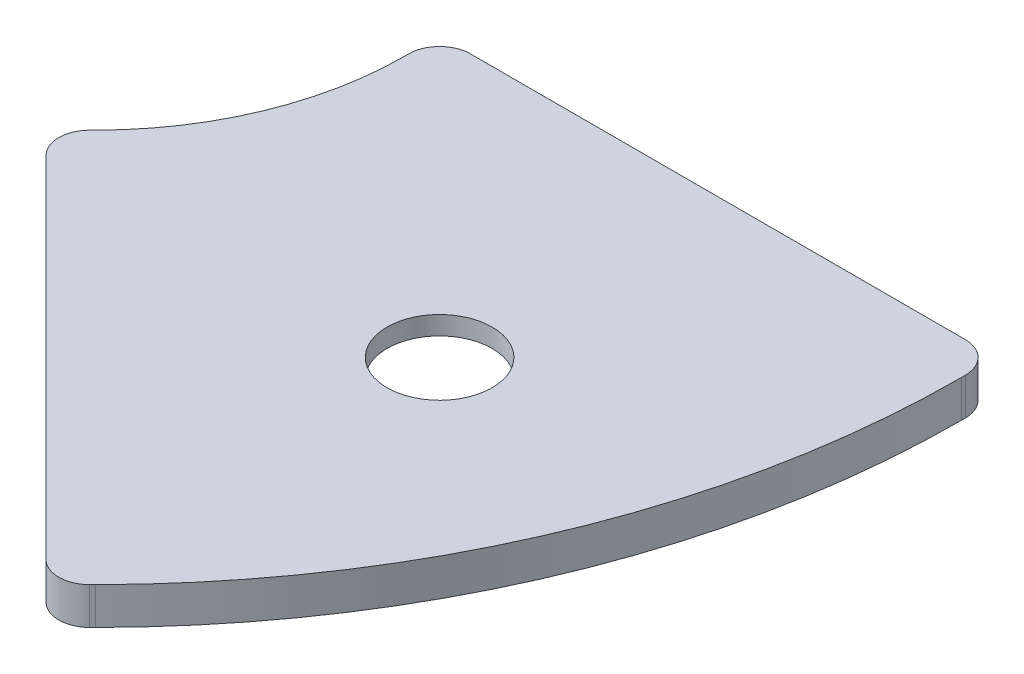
ISO-10303-21;
HEADER;
FILE_DESCRIPTION(('STEP AP214'),'2;1');
FILE_NAME('part.step','',(''),(''),'','','');
FILE_SCHEMA(('AUTOMOTIVE_DESIGN { 1 0 10303 214 1 1 1 1 }'));
ENDSEC;
DATA;
#1=APPLICATION_CONTEXT('core data for automotive mechanical design processes');
#2=APPLICATION_PROTOCOL_DEFINITION('international standard','automotive_design',2000,#1);
#3=PRODUCT_CONTEXT('',#1,'mechanical');
#4=PRODUCT('Part','Part','',(#3));
#5=PRODUCT_RELATED_PRODUCT_CATEGORY('part','',(#4));
#6=PRODUCT_DEFINITION_FORMATION('','',#4);
#7=PRODUCT_DEFINITION_CONTEXT('part definition',#1,'design');
#8=PRODUCT_DEFINITION('design','',#6,#7);
#9=PRODUCT_DEFINITION_SHAPE('','',#8);
#10=(LENGTH_UNIT() NAMED_UNIT(*) SI_UNIT(.MILLI.,.METRE.));
#11=(NAMED_UNIT(*) PLANE_ANGLE_UNIT() SI_UNIT($,.RADIAN.));
#12=(NAMED_UNIT(*) SI_UNIT($,.STERADIAN.) SOLID_ANGLE_UNIT());
#13=UNCERTAINTY_MEASURE_WITH_UNIT(LENGTH_MEASURE(1.E-05),#10,'distance_accuracy_value','');
#14=(GEOMETRIC_REPRESENTATION_CONTEXT(3) GLOBAL_UNCERTAINTY_ASSIGNED_CONTEXT((#13)) GLOBAL_UNIT_ASSIGNED_CONTEXT((#10,
#11,#12)) REPRESENTATION_CONTEXT('',''));
#15=CARTESIAN_POINT('',(0.,0.,0.));
#16=DIRECTION('',(0.,0.,1.));
#17=DIRECTION('',(1.,0.,0.));
#18=AXIS2_PLACEMENT_3D('',#15,#16,#17);
#19=CARTESIAN_POINT('',(22.5,-1.5,22.5));
#20=DIRECTION('',(0.,1.,0.));
#21=DIRECTION('',(1.,0.,0.));
#22=AXIS2_PLACEMENT_3D('',#19,#20,#21);
#23=CYLINDRICAL_SURFACE('',#22,4.25);
#24=CARTESIAN_POINT('',(22.5,0.,22.5));
#25=DIRECTION('',(0.,-1.,0.));
#26=DIRECTION('',(0.,0.,-1.));
#27=AXIS2_PLACEMENT_3D('',#24,#25,#26);
#28=CIRCLE('',#27,4.25);
#29=CARTESIAN_POINT('',(22.5,0.,18.25));
#30=VERTEX_POINT('',#29);
#31=EDGE_CURVE('E194',#30,#30,#28,.T.);
#32=ORIENTED_EDGE('',*,*,#31,.F.);
#33=EDGE_LOOP('',(#32));
#34=FACE_BOUND('',#33,.T.);
#35=CARTESIAN_POINT('',(22.5,-1.5,22.5));
#36=DIRECTION('',(0.,-1.,0.));
#37=DIRECTION('',(0.,0.,-1.));
#38=AXIS2_PLACEMENT_3D('',#35,#36,#37);
#39=CIRCLE('',#38,4.25);
#40=CARTESIAN_POINT('',(22.5,-1.5,18.25));
#41=VERTEX_POINT('',#40);
#42=EDGE_CURVE('E9',#41,#41,#39,.T.);
#43=ORIENTED_EDGE('',*,*,#42,.T.);
#44=EDGE_LOOP('',(#43));
#45=FACE_BOUND('',#44,.T.);
#46=ADVANCED_FACE('F15',(#34,#45),#23,.F.);
#47=CARTESIAN_POINT('',(22.5,-2.3,22.5));
#48=DIRECTION('',(0.,1.,0.));
#49=DIRECTION('',(1.,0.,0.));
#50=AXIS2_PLACEMENT_3D('',#47,#48,#49);
#51=CYLINDRICAL_SURFACE('',#50,6.5);
#52=CARTESIAN_POINT('',(22.5,-1.5,22.5));
#53=DIRECTION('',(0.,1.,0.));
#54=DIRECTION('',(1.,0.,0.));
#55=AXIS2_PLACEMENT_3D('',#52,#53,#54);
#56=CIRCLE('',#55,6.5);
#57=CARTESIAN_POINT('',(29.,-1.5,22.5));
#58=VERTEX_POINT('',#57);
#59=EDGE_CURVE('E25',#58,#58,#56,.T.);
#60=ORIENTED_EDGE('',*,*,#59,.T.);
#61=EDGE_LOOP('',(#60));
#62=FACE_BOUND('',#61,.T.);
#63=CARTESIAN_POINT('',(22.5,-3.,22.5));
#64=DIRECTION('',(0.,1.,0.));
#65=DIRECTION('',(1.,0.,0.));
#66=AXIS2_PLACEMENT_3D('',#63,#64,#65);
#67=CIRCLE('',#66,6.5);
#68=CARTESIAN_POINT('',(29.,-3.,22.5));
#69=VERTEX_POINT('',#68);
#70=EDGE_CURVE('E204',#69,#69,#67,.T.);
#71=ORIENTED_EDGE('',*,*,#70,.F.);
#72=EDGE_LOOP('',(#71));
#73=FACE_BOUND('',#72,.T.);
#74=ADVANCED_FACE('F214',(#62,#73),#51,.F.);
#75=CARTESIAN_POINT('',(22.5,-1.5,22.5));
#76=DIRECTION('',(0.,1.,0.));
#77=DIRECTION('',(0.,0.,1.));
#78=AXIS2_PLACEMENT_3D('',#75,#76,#77);
#79=PLANE('',#78);
#80=ORIENTED_EDGE('',*,*,#59,.F.);
#81=EDGE_LOOP('',(#80));
#82=FACE_BOUND('',#81,.T.);
#83=ORIENTED_EDGE('',*,*,#42,.F.);
#84=EDGE_LOOP('',(#83));
#85=FACE_BOUND('',#84,.T.);
#86=ADVANCED_FACE('F218',(#82,#85),#79,.F.);
#87=CARTESIAN_POINT('',(0.,0.,2.5));
#88=DIRECTION('',(-1.,0.,0.));
#89=DIRECTION('',(0.,0.,1.));
#90=AXIS2_PLACEMENT_3D('',#87,#88,#89);
#91=PLANE('',#90);
#92=DIRECTION('',(0.,0.,1.));
#93=VECTOR('',#92,1.);
#94=CARTESIAN_POINT('',(0.,-3.,2.5));
#95=LINE('',#94,#93);
#96=CARTESIAN_POINT('',(0.,-3.,2.5));
#97=VERTEX_POINT('',#96);
#98=CARTESIAN_POINT('',(0.,-3.,2.82485579));
#99=VERTEX_POINT('',#98);
#100=EDGE_CURVE('E201',#97,#99,#95,.T.);
#101=ORIENTED_EDGE('',*,*,#100,.T.);
#102=DIRECTION('',(0.,-1.,0.));
#103=VECTOR('',#102,1.);
#104=CARTESIAN_POINT('',(0.,0.,2.82485579));
#105=LINE('',#104,#103);
#106=CARTESIAN_POINT('',(0.,0.,2.82485579));
#107=VERTEX_POINT('',#106);
#108=EDGE_CURVE('E34',#107,#99,#105,.T.);
#109=ORIENTED_EDGE('',*,*,#108,.F.);
#110=DIRECTION('',(0.,0.,-1.));
#111=VECTOR('',#110,1.);
#112=CARTESIAN_POINT('',(0.,0.,2.82485579));
#113=LINE('',#112,#111);
#114=CARTESIAN_POINT('',(0.,0.,2.5));
#115=VERTEX_POINT('',#114);
#116=EDGE_CURVE('E199',#107,#115,#113,.T.);
#117=ORIENTED_EDGE('',*,*,#116,.T.);
#118=DIRECTION('',(0.,-1.,0.));
#119=VECTOR('',#118,1.);
#120=CARTESIAN_POINT('',(0.,0.,2.5));
#121=LINE('',#120,#119);
#122=EDGE_CURVE('E126',#115,#97,#121,.T.);
#123=ORIENTED_EDGE('',*,*,#122,.T.);
#124=EDGE_LOOP('',(#101,#109,#117,#123));
#125=FACE_BOUND('',#124,.T.);
#126=ADVANCED_FACE('F220',(#125),#91,.T.);
#127=CARTESIAN_POINT('',(-25.0000000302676,0.,2.82485577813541));
#128=DIRECTION('',(0.,1.,0.));
#129=DIRECTION('',(1.,0.,0.));
#130=AXIS2_PLACEMENT_3D('',#127,#128,#129);
#131=CYLINDRICAL_SURFACE('',#130,25.0000000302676);
#132=CARTESIAN_POINT('',(-25.0000000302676,-3.,2.82485577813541));
#133=DIRECTION('',(0.,-1.,0.));
#134=DIRECTION('',(0.,0.,-1.));
#135=AXIS2_PLACEMENT_3D('',#132,#133,#134);
#136=CIRCLE('',#135,25.0000000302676);
#137=CARTESIAN_POINT('',(-7.32233047,-3.,20.50252532));
#138=VERTEX_POINT('',#137);
#139=EDGE_CURVE('E196',#99,#138,#136,.T.);
#140=ORIENTED_EDGE('',*,*,#139,.T.);
#141=DIRECTION('',(0.,-1.,0.));
#142=VECTOR('',#141,1.);
#143=CARTESIAN_POINT('',(-7.32233047,0.,20.50252532));
#144=LINE('',#143,#142);
#145=CARTESIAN_POINT('',(-7.32233047,0.,20.50252532));
#146=VERTEX_POINT('',#145);
#147=EDGE_CURVE('E185',#146,#138,#144,.T.);
#148=ORIENTED_EDGE('',*,*,#147,.F.);
#149=CARTESIAN_POINT('',(-25.0000000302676,0.,2.82485577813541));
#150=DIRECTION('',(0.,-1.,0.));
#151=DIRECTION('',(0.,0.,-1.));
#152=AXIS2_PLACEMENT_3D('',#149,#150,#151);
#153=CIRCLE('',#152,25.0000000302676);
#154=EDGE_CURVE('E112',#107,#146,#153,.T.);
#155=ORIENTED_EDGE('',*,*,#154,.F.);
#156=ORIENTED_EDGE('',*,*,#108,.T.);
#157=EDGE_LOOP('',(#140,#148,#155,#156));
#158=FACE_BOUND('',#157,.T.);
#159=ADVANCED_FACE('F228',(#158),#131,.F.);
#160=CARTESIAN_POINT('',(-7.32233047,0.,20.50252532));
#161=DIRECTION('',(-0.707106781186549,0.,-0.707106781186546));
#162=DIRECTION('',(-0.707106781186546,0.,0.707106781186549));
#163=AXIS2_PLACEMENT_3D('',#160,#161,#162);
#164=PLANE('',#163);
#165=DIRECTION('',(-0.707106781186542,0.,0.707106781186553));
#166=VECTOR('',#165,1.);
#167=CARTESIAN_POINT('',(-7.32233047,-3.,20.50252532));
#168=LINE('',#167,#166);
#169=CARTESIAN_POINT('',(-7.5520382,-3.,20.73223305));
#170=VERTEX_POINT('',#169);
#171=EDGE_CURVE('E189',#138,#170,#168,.T.);
#172=ORIENTED_EDGE('',*,*,#171,.T.);
#173=DIRECTION('',(0.,-1.,0.));
#174=VECTOR('',#173,1.);
#175=CARTESIAN_POINT('',(-7.5520382,0.,20.73223305));
#176=LINE('',#175,#174);
#177=CARTESIAN_POINT('',(-7.5520382,0.,20.73223305));
#178=VERTEX_POINT('',#177);
#179=EDGE_CURVE('E177',#178,#170,#176,.T.);
#180=ORIENTED_EDGE('',*,*,#179,.F.);
#181=DIRECTION('',(0.707106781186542,0.,-0.707106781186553));
#182=VECTOR('',#181,1.);
#183=CARTESIAN_POINT('',(-7.5520382,0.,20.73223305));
#184=LINE('',#183,#182);
#185=EDGE_CURVE('E186',#178,#146,#184,.T.);
#186=ORIENTED_EDGE('',*,*,#185,.T.);
#187=ORIENTED_EDGE('',*,*,#147,.T.);
#188=EDGE_LOOP('',(#172,#180,#186,#187));
#189=FACE_BOUND('',#188,.T.);
#190=ADVANCED_FACE('F235',(#189),#164,.T.);
#191=CARTESIAN_POINT('',(-5.78427125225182,0.,22.500000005));
#192=DIRECTION('',(0.,1.,0.));
#193=DIRECTION('',(1.,0.,0.));
#194=AXIS2_PLACEMENT_3D('',#191,#192,#193);
#195=CYLINDRICAL_SURFACE('',#194,2.49999999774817);
#196=CARTESIAN_POINT('',(-5.78427125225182,-3.,22.500000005));
#197=DIRECTION('',(0.,1.,0.));
#198=DIRECTION('',(1.,0.,0.));
#199=AXIS2_PLACEMENT_3D('',#196,#197,#198);
#200=CIRCLE('',#199,2.49999999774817);
#201=CARTESIAN_POINT('',(-7.5520382,-3.,24.26776696));
#202=VERTEX_POINT('',#201);
#203=EDGE_CURVE('E181',#170,#202,#200,.T.);
#204=ORIENTED_EDGE('',*,*,#203,.T.);
#205=DIRECTION('',(0.,-1.,0.));
#206=VECTOR('',#205,1.);
#207=CARTESIAN_POINT('',(-7.5520382,0.,24.26776696));
#208=LINE('',#207,#206);
#209=CARTESIAN_POINT('',(-7.5520382,0.,24.26776696));
#210=VERTEX_POINT('',#209);
#211=EDGE_CURVE('E169',#210,#202,#208,.T.);
#212=ORIENTED_EDGE('',*,*,#211,.F.);
#213=CARTESIAN_POINT('',(-5.78427125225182,0.,22.500000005));
#214=DIRECTION('',(0.,-1.,0.));
#215=DIRECTION('',(0.,0.,-1.));
#216=AXIS2_PLACEMENT_3D('',#213,#214,#215);
#217=CIRCLE('',#216,2.49999999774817);
#218=EDGE_CURVE('E178',#210,#178,#217,.T.);
#219=ORIENTED_EDGE('',*,*,#218,.T.);
#220=ORIENTED_EDGE('',*,*,#179,.T.);
#221=EDGE_LOOP('',(#204,#212,#219,#220));
#222=FACE_BOUND('',#221,.T.);
#223=ADVANCED_FACE('F238',(#222),#195,.T.);
#224=CARTESIAN_POINT('',(-7.5520382,0.,24.26776696));
#225=DIRECTION('',(-0.707106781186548,0.,0.707106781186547));
#226=DIRECTION('',(0.707106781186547,0.,0.707106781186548));
#227=AXIS2_PLACEMENT_3D('',#224,#225,#226);
#228=PLANE('',#227);
#229=DIRECTION('',(0.707106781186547,0.,0.707106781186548));
#230=VECTOR('',#229,1.);
#231=CARTESIAN_POINT('',(-7.5520382,-3.,24.26776696));
#232=LINE('',#231,#230);
#233=CARTESIAN_POINT('',(20.73223305,-3.,52.55203821));
#234=VERTEX_POINT('',#233);
#235=EDGE_CURVE('E173',#202,#234,#232,.T.);
#236=ORIENTED_EDGE('',*,*,#235,.T.);
#237=DIRECTION('',(0.,-1.,0.));
#238=VECTOR('',#237,1.);
#239=CARTESIAN_POINT('',(20.73223305,0.,52.55203821));
#240=LINE('',#239,#238);
#241=CARTESIAN_POINT('',(20.73223305,0.,52.55203821));
#242=VERTEX_POINT('',#241);
#243=EDGE_CURVE('E161',#242,#234,#240,.T.);
#244=ORIENTED_EDGE('',*,*,#243,.F.);
#245=DIRECTION('',(-0.707106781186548,0.,-0.707106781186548));
#246=VECTOR('',#245,1.);
#247=CARTESIAN_POINT('',(20.73223305,0.,52.55203821));
#248=LINE('',#247,#246);
#249=EDGE_CURVE('E170',#242,#210,#248,.T.);
#250=ORIENTED_EDGE('',*,*,#249,.T.);
#251=ORIENTED_EDGE('',*,*,#211,.T.);
#252=EDGE_LOOP('',(#236,#244,#250,#251));
#253=FACE_BOUND('',#252,.T.);
#254=ADVANCED_FACE('F240',(#253),#228,.T.);
#255=CARTESIAN_POINT('',(22.500000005,0.,50.7842712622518));
#256=DIRECTION('',(0.,1.,0.));
#257=DIRECTION('',(1.,0.,0.));
#258=AXIS2_PLACEMENT_3D('',#255,#256,#257);
#259=CYLINDRICAL_SURFACE('',#258,2.49999999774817);
#260=CARTESIAN_POINT('',(22.500000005,-3.,50.7842712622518));
#261=DIRECTION('',(0.,1.,0.));
#262=DIRECTION('',(1.,0.,0.));
#263=AXIS2_PLACEMENT_3D('',#260,#261,#262);
#264=CIRCLE('',#263,2.49999999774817);
#265=CARTESIAN_POINT('',(24.26776696,-3.,52.55203821));
#266=VERTEX_POINT('',#265);
#267=EDGE_CURVE('E165',#234,#266,#264,.T.);
#268=ORIENTED_EDGE('',*,*,#267,.T.);
#269=DIRECTION('',(0.,-1.,0.));
#270=VECTOR('',#269,1.);
#271=CARTESIAN_POINT('',(24.26776696,0.,52.55203821));
#272=LINE('',#271,#270);
#273=CARTESIAN_POINT('',(24.26776696,0.,52.55203821));
#274=VERTEX_POINT('',#273);
#275=EDGE_CURVE('E153',#274,#266,#272,.T.);
#276=ORIENTED_EDGE('',*,*,#275,.F.);
#277=CARTESIAN_POINT('',(22.500000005,0.,50.7842712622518));
#278=DIRECTION('',(0.,-1.,0.));
#279=DIRECTION('',(0.,0.,-1.));
#280=AXIS2_PLACEMENT_3D('',#277,#278,#279);
#281=CIRCLE('',#280,2.49999999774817);
#282=EDGE_CURVE('E162',#274,#242,#281,.T.);
#283=ORIENTED_EDGE('',*,*,#282,.T.);
#284=ORIENTED_EDGE('',*,*,#243,.T.);
#285=EDGE_LOOP('',(#268,#276,#283,#284));
#286=FACE_BOUND('',#285,.T.);
#287=ADVANCED_FACE('F243',(#286),#259,.T.);
#288=CARTESIAN_POINT('',(24.26776696,0.,52.55203821));
#289=DIRECTION('',(0.707106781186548,0.,0.707106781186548));
#290=DIRECTION('',(0.707106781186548,0.,-0.707106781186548));
#291=AXIS2_PLACEMENT_3D('',#288,#289,#290);
#292=PLANE('',#291);
#293=DIRECTION('',(0.707106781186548,0.,-0.707106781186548));
#294=VECTOR('',#293,1.);
#295=CARTESIAN_POINT('',(24.26776696,-3.,52.55203821));
#296=LINE('',#295,#294);
#297=CARTESIAN_POINT('',(24.49747469,-3.,52.32233048));
#298=VERTEX_POINT('',#297);
#299=EDGE_CURVE('E157',#266,#298,#296,.T.);
#300=ORIENTED_EDGE('',*,*,#299,.T.);
#301=DIRECTION('',(0.,-1.,0.));
#302=VECTOR('',#301,1.);
#303=CARTESIAN_POINT('',(24.49747469,0.,52.32233048));
#304=LINE('',#303,#302);
#305=CARTESIAN_POINT('',(24.49747469,0.,52.32233048));
#306=VERTEX_POINT('',#305);
#307=EDGE_CURVE('E145',#306,#298,#304,.T.);
#308=ORIENTED_EDGE('',*,*,#307,.F.);
#309=DIRECTION('',(-0.707106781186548,0.,0.707106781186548));
#310=VECTOR('',#309,1.);
#311=CARTESIAN_POINT('',(24.49747469,0.,52.32233048));
#312=LINE('',#311,#310);
#313=EDGE_CURVE('E154',#306,#274,#312,.T.);
#314=ORIENTED_EDGE('',*,*,#313,.T.);
#315=ORIENTED_EDGE('',*,*,#275,.T.);
#316=EDGE_LOOP('',(#300,#308,#314,#315));
#317=FACE_BOUND('',#316,.T.);
#318=ADVANCED_FACE('F245',(#317),#292,.T.);
#319=CARTESIAN_POINT('',(-25.0000000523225,0.,2.8248557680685));
#320=DIRECTION('',(0.,1.,0.));
#321=DIRECTION('',(1.,0.,0.));
#322=AXIS2_PLACEMENT_3D('',#319,#320,#321);
#323=CYLINDRICAL_SURFACE('',#322,70.0000000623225);
#324=CARTESIAN_POINT('',(-25.0000000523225,-3.,2.8248557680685));
#325=DIRECTION('',(0.,1.,0.));
#326=DIRECTION('',(1.,0.,0.));
#327=AXIS2_PLACEMENT_3D('',#324,#325,#326);
#328=CIRCLE('',#327,70.0000000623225);
#329=CARTESIAN_POINT('',(45.00000001,-3.,2.8248558));
#330=VERTEX_POINT('',#329);
#331=EDGE_CURVE('E149',#298,#330,#328,.T.);
#332=ORIENTED_EDGE('',*,*,#331,.T.);
#333=DIRECTION('',(0.,-1.,0.));
#334=VECTOR('',#333,1.);
#335=CARTESIAN_POINT('',(45.00000001,0.,2.8248558));
#336=LINE('',#335,#334);
#337=CARTESIAN_POINT('',(45.00000001,0.,2.8248558));
#338=VERTEX_POINT('',#337);
#339=EDGE_CURVE('E137',#338,#330,#336,.T.);
#340=ORIENTED_EDGE('',*,*,#339,.F.);
#341=CARTESIAN_POINT('',(-25.0000000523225,0.,2.8248557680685));
#342=DIRECTION('',(0.,-1.,0.));
#343=DIRECTION('',(0.,0.,-1.));
#344=AXIS2_PLACEMENT_3D('',#341,#342,#343);
#345=CIRCLE('',#344,70.0000000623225);
#346=EDGE_CURVE('E146',#338,#306,#345,.T.);
#347=ORIENTED_EDGE('',*,*,#346,.T.);
#348=ORIENTED_EDGE('',*,*,#307,.T.);
#349=EDGE_LOOP('',(#332,#340,#347,#348));
#350=FACE_BOUND('',#349,.T.);
#351=ADVANCED_FACE('F248',(#350),#323,.T.);
#352=CARTESIAN_POINT('',(45.00000001,0.,2.8248558));
#353=DIRECTION('',(1.,0.,0.));
#354=DIRECTION('',(0.,0.,-1.));
#355=AXIS2_PLACEMENT_3D('',#352,#353,#354);
#356=PLANE('',#355);
#357=DIRECTION('',(0.,0.,-1.));
#358=VECTOR('',#357,1.);
#359=CARTESIAN_POINT('',(45.00000001,-3.,2.8248558));
#360=LINE('',#359,#358);
#361=CARTESIAN_POINT('',(45.00000001,-3.,2.50000001));
#362=VERTEX_POINT('',#361);
#363=EDGE_CURVE('E141',#330,#362,#360,.T.);
#364=ORIENTED_EDGE('',*,*,#363,.T.);
#365=DIRECTION('',(0.,-1.,0.));
#366=VECTOR('',#365,1.);
#367=CARTESIAN_POINT('',(45.00000001,0.,2.50000001));
#368=LINE('',#367,#366);
#369=CARTESIAN_POINT('',(45.00000001,0.,2.50000001));
#370=VERTEX_POINT('',#369);
#371=EDGE_CURVE('E132',#370,#362,#368,.T.);
#372=ORIENTED_EDGE('',*,*,#371,.F.);
#373=DIRECTION('',(0.,0.,1.));
#374=VECTOR('',#373,1.);
#375=CARTESIAN_POINT('',(45.00000001,0.,2.50000001));
#376=LINE('',#375,#374);
#377=EDGE_CURVE('E138',#370,#338,#376,.T.);
#378=ORIENTED_EDGE('',*,*,#377,.T.);
#379=ORIENTED_EDGE('',*,*,#339,.T.);
#380=EDGE_LOOP('',(#364,#372,#378,#379));
#381=FACE_BOUND('',#380,.T.);
#382=ADVANCED_FACE('F250',(#381),#356,.T.);
#383=CARTESIAN_POINT('',(42.4999999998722,0.,2.50000002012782));
#384=DIRECTION('',(0.,1.,0.));
#385=DIRECTION('',(1.,0.,0.));
#386=AXIS2_PLACEMENT_3D('',#383,#384,#385);
#387=CYLINDRICAL_SURFACE('',#386,2.50000001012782);
#388=CARTESIAN_POINT('',(42.4999999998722,-3.,2.50000002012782));
#389=DIRECTION('',(0.,1.,0.));
#390=DIRECTION('',(1.,0.,0.));
#391=AXIS2_PLACEMENT_3D('',#388,#389,#390);
#392=CIRCLE('',#391,2.50000001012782);
#393=CARTESIAN_POINT('',(42.50000001,-3.,1.00000017E-08));
#394=VERTEX_POINT('',#393);
#395=EDGE_CURVE('E133',#362,#394,#392,.T.);
#396=ORIENTED_EDGE('',*,*,#395,.T.);
#397=DIRECTION('',(0.,-1.,0.));
#398=VECTOR('',#397,1.);
#399=CARTESIAN_POINT('',(42.50000001,0.,1.00000017E-08));
#400=LINE('',#399,#398);
#401=CARTESIAN_POINT('',(42.50000001,0.,1.00000017E-08));
#402=VERTEX_POINT('',#401);
#403=EDGE_CURVE('E123',#402,#394,#400,.T.);
#404=ORIENTED_EDGE('',*,*,#403,.F.);
#405=CARTESIAN_POINT('',(42.4999999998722,0.,2.50000002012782));
#406=DIRECTION('',(0.,-1.,0.));
#407=DIRECTION('',(0.,0.,-1.));
#408=AXIS2_PLACEMENT_3D('',#405,#406,#407);
#409=CIRCLE('',#408,2.50000001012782);
#410=EDGE_CURVE('E122',#402,#370,#409,.T.);
#411=ORIENTED_EDGE('',*,*,#410,.T.);
#412=ORIENTED_EDGE('',*,*,#371,.T.);
#413=EDGE_LOOP('',(#396,#404,#411,#412));
#414=FACE_BOUND('',#413,.T.);
#415=ADVANCED_FACE('F253',(#414),#387,.T.);
#416=CARTESIAN_POINT('',(42.50000001,0.,1.00000017E-08));
#417=DIRECTION('',(0.,0.,-1.));
#418=DIRECTION('',(-1.,0.,0.));
#419=AXIS2_PLACEMENT_3D('',#416,#417,#418);
#420=PLANE('',#419);
#421=DIRECTION('',(-1.,0.,0.));
#422=VECTOR('',#421,1.);
#423=CARTESIAN_POINT('',(42.50000001,-3.,1.00000017E-08));
#424=LINE('',#423,#422);
#425=CARTESIAN_POINT('',(2.5,-3.,4.81481564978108E-09));
#426=VERTEX_POINT('',#425);
#427=EDGE_CURVE('E110',#394,#426,#424,.T.);
#428=ORIENTED_EDGE('',*,*,#427,.T.);
#429=DIRECTION('',(0.,-1.,0.));
#430=VECTOR('',#429,1.);
#431=CARTESIAN_POINT('',(2.5,0.,0.));
#432=LINE('',#431,#430);
#433=CARTESIAN_POINT('',(2.5,0.,4.81481564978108E-09));
#434=VERTEX_POINT('',#433);
#435=EDGE_CURVE('E102',#434,#426,#432,.T.);
#436=ORIENTED_EDGE('',*,*,#435,.F.);
#437=DIRECTION('',(1.,0.,0.));
#438=VECTOR('',#437,1.);
#439=CARTESIAN_POINT('',(2.5,0.,1.00000017E-08));
#440=LINE('',#439,#438);
#441=EDGE_CURVE('E108',#434,#402,#440,.T.);
#442=ORIENTED_EDGE('',*,*,#441,.T.);
#443=ORIENTED_EDGE('',*,*,#403,.T.);
#444=EDGE_LOOP('',(#428,#436,#442,#443));
#445=FACE_BOUND('',#444,.T.);
#446=ADVANCED_FACE('F107',(#445),#420,.T.);
#447=CARTESIAN_POINT('',(2.50000001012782,0.,2.50000001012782));
#448=DIRECTION('',(0.,1.,0.));
#449=DIRECTION('',(1.,0.,0.));
#450=AXIS2_PLACEMENT_3D('',#447,#448,#449);
#451=CYLINDRICAL_SURFACE('',#450,2.50000001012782);
#452=CARTESIAN_POINT('',(2.50000001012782,-3.,2.50000001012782));
#453=DIRECTION('',(0.,1.,0.));
#454=DIRECTION('',(1.,0.,0.));
#455=AXIS2_PLACEMENT_3D('',#452,#453,#454);
#456=CIRCLE('',#455,2.50000001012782);
#457=EDGE_CURVE('E128',#426,#97,#456,.T.);
#458=ORIENTED_EDGE('',*,*,#457,.T.);
#459=ORIENTED_EDGE('',*,*,#122,.F.);
#460=CARTESIAN_POINT('',(2.50000001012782,0.,2.50000001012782));
#461=DIRECTION('',(0.,-1.,0.));
#462=DIRECTION('',(0.,0.,-1.));
#463=AXIS2_PLACEMENT_3D('',#460,#461,#462);
#464=CIRCLE('',#463,2.50000001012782);
#465=EDGE_CURVE('E19',#115,#434,#464,.T.);
#466=ORIENTED_EDGE('',*,*,#465,.T.);
#467=ORIENTED_EDGE('',*,*,#435,.T.);
#468=EDGE_LOOP('',(#458,#459,#466,#467));
#469=FACE_BOUND('',#468,.T.);
#470=ADVANCED_FACE('F17',(#469),#451,.T.);
#471=CARTESIAN_POINT('',(20.0361348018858,0.,21.4794336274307));
#472=DIRECTION('',(0.,-1.,0.));
#473=DIRECTION('',(0.,0.,-1.));
#474=AXIS2_PLACEMENT_3D('',#471,#472,#473);
#475=PLANE('',#474);
#476=ORIENTED_EDGE('',*,*,#465,.F.);
#477=ORIENTED_EDGE('',*,*,#116,.F.);
#478=ORIENTED_EDGE('',*,*,#154,.T.);
#479=ORIENTED_EDGE('',*,*,#185,.F.);
#480=ORIENTED_EDGE('',*,*,#218,.F.);
#481=ORIENTED_EDGE('',*,*,#249,.F.);
#482=ORIENTED_EDGE('',*,*,#282,.F.);
#483=ORIENTED_EDGE('',*,*,#313,.F.);
#484=ORIENTED_EDGE('',*,*,#346,.F.);
#485=ORIENTED_EDGE('',*,*,#377,.F.);
#486=ORIENTED_EDGE('',*,*,#410,.F.);
#487=ORIENTED_EDGE('',*,*,#441,.F.);
#488=EDGE_LOOP('',(#476,#477,#478,#479,#480,#481,#482,#483,#484,#485,#486,#487));
#489=FACE_BOUND('',#488,.T.);
#490=ORIENTED_EDGE('',*,*,#31,.T.);
#491=EDGE_LOOP('',(#490));
#492=FACE_BOUND('',#491,.T.);
#493=ADVANCED_FACE('F117',(#489,#492),#475,.F.);
#494=CARTESIAN_POINT('',(20.0361348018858,-3.,21.4794336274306));
#495=DIRECTION('',(0.,-1.,0.));
#496=DIRECTION('',(0.,0.,-1.));
#497=AXIS2_PLACEMENT_3D('',#494,#495,#496);
#498=PLANE('',#497);
#499=ORIENTED_EDGE('',*,*,#100,.F.);
#500=ORIENTED_EDGE('',*,*,#457,.F.);
#501=ORIENTED_EDGE('',*,*,#427,.F.);
#502=ORIENTED_EDGE('',*,*,#395,.F.);
#503=ORIENTED_EDGE('',*,*,#363,.F.);
#504=ORIENTED_EDGE('',*,*,#331,.F.);
#505=ORIENTED_EDGE('',*,*,#299,.F.);
#506=ORIENTED_EDGE('',*,*,#267,.F.);
#507=ORIENTED_EDGE('',*,*,#235,.F.);
#508=ORIENTED_EDGE('',*,*,#203,.F.);
#509=ORIENTED_EDGE('',*,*,#171,.F.);
#510=ORIENTED_EDGE('',*,*,#139,.F.);
#511=EDGE_LOOP('',(#499,#500,#501,#502,#503,#504,#505,#506,#507,#508,#509,#510));
#512=FACE_BOUND('',#511,.T.);
#513=ORIENTED_EDGE('',*,*,#70,.T.);
#514=EDGE_LOOP('',(#513));
#515=FACE_BOUND('',#514,.T.);
#516=ADVANCED_FACE('F259',(#512,#515),#498,.T.);
#517=CLOSED_SHELL('',(#46,#74,#86,#126,#159,#190,#223,#254,#287,#318,#351,#382,#415,#446,#470,
#493,#516));
#518=MANIFOLD_SOLID_BREP('B1',#517);
#519=ADVANCED_BREP_SHAPE_REPRESENTATION('',(#18,#518),#14);
#520=SHAPE_DEFINITION_REPRESENTATION(#9,#519);
ENDSEC;
END-ISO-10303-21;
